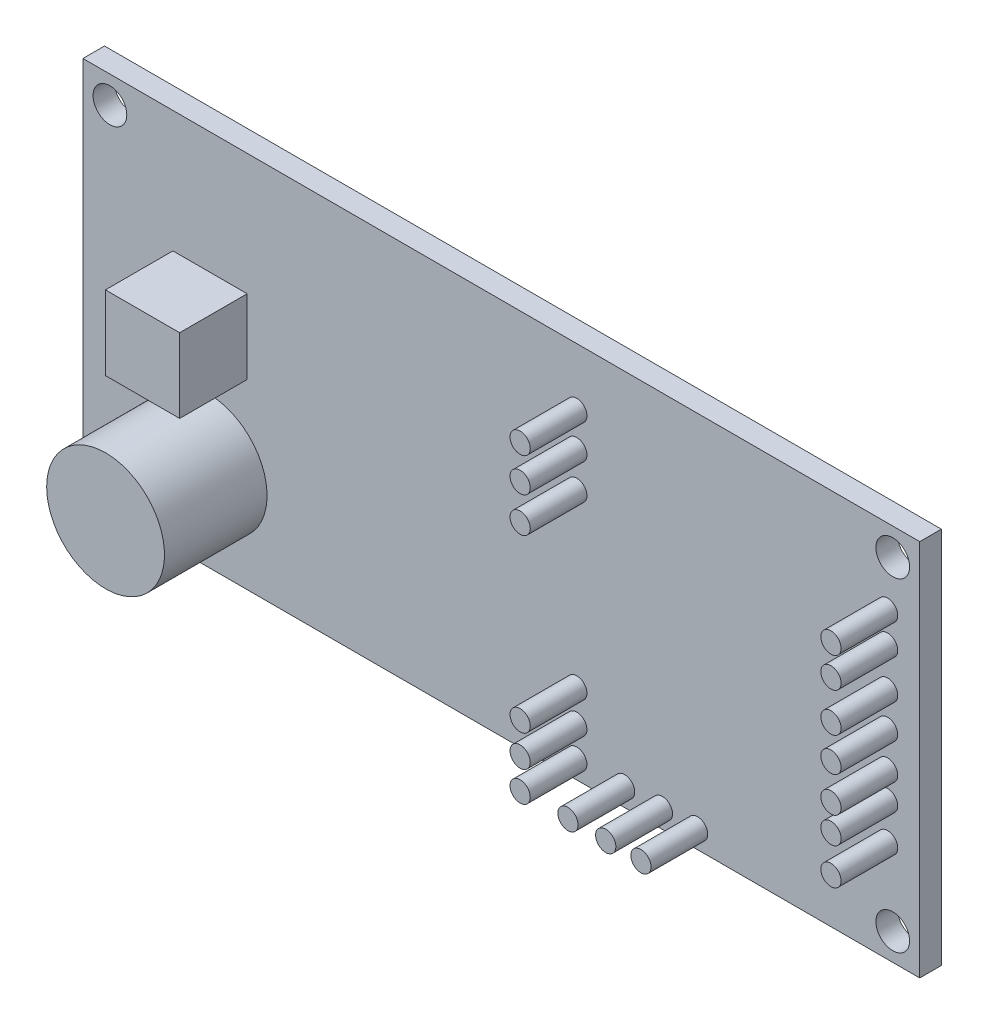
from build123d import *

# Parameters (mm, degrees)
SKETCH1_W      = 62
SKETCH1_H      = 28
SKETCH1_R      = 1.25
EXTRUDE1_DEPTH = 0.8
SKETCH3_R      = 0.75
EXTRUDE3_DEPTH = 4.2
SKETCH4_R      = 4.364752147
EXTRUDE4_DEPTH = 7.6
SKETCH5_W      = 5.500362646
SKETCH5_H      = 5.500362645
EXTRUDE5_DEPTH = 5
SKETCH6_W      = 4.195191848
SKETCH6_H      = 3.635832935
SKETCH6_W_2    = 4.101965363
EXTRUDE6_DEPTH = 3.1


with BuildPart() as part:
    # Sketch1 → Extrude1 (new, symmetric)
    with BuildSketch(Plane.XY):
        with Locations((31, 14)):
            Rectangle(SKETCH1_W, SKETCH1_H)
        with Locations((2, 2)):
            Circle(SKETCH1_R, mode=Mode.SUBTRACT)
        with Locations((60, 26)):
            Circle(SKETCH1_R, mode=Mode.SUBTRACT)
        with Locations((60, 2)):
            Circle(SKETCH1_R, mode=Mode.SUBTRACT)
        with Locations((2, 26)):
            Circle(SKETCH1_R, mode=Mode.SUBTRACT)
    extrude(amount=EXTRUDE1_DEPTH, both=True)

    # Sketch3 → Extrude3 (add)
    with BuildSketch(Plane.XY.offset(0.8)):
        with Locations(Location((59.620531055, 22.43699694, 0), (0, 0, 180))):
            Circle(SKETCH3_R)
        with Locations(Location((59.620531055, 20.199561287, 0), (0, 0, 180))):
            Circle(SKETCH3_R)
        with Locations(Location((59.620531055, 17.309540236, 0), (0, 0, 180))):
            Circle(SKETCH3_R)
        with Locations(Location((59.620531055, 14.792425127, 0), (0, 0, 180))):
            Circle(SKETCH3_R)
        with Locations(Location((59.620531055, 12.182083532, 0), (0, 0, 180))):
            Circle(SKETCH3_R)
        with Locations(Location((59.620531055, 10.224327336, 0), (0, 0, 180))):
            Circle(SKETCH3_R)
        with Locations(Location((59.620531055, 7.520759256, 0), (0, 0, 180))):
            Circle(SKETCH3_R)
        with Locations(Location((36.593589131, 21.225052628, 0), (0, 0, 180))):
            Circle(SKETCH3_R)
        with Locations(Location((36.593589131, 23.742167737, 0), (0, 0, 180))):
            Circle(SKETCH3_R)
        with Locations(Location((36.593589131, 18.614711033, 0), (0, 0, 180))):
            Circle(SKETCH3_R)
        with Locations(Location((36.593589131, 5.935909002, 0), (0, 0, 180))):
            Circle(SKETCH3_R)
        with Locations(Location((36.593589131, 3.605246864, 0), (0, 0, 180))):
            Circle(SKETCH3_R)
        with Locations(Location((36.593589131, 1.367811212, 0), (0, 0, 180))):
            Circle(SKETCH3_R)
        with Locations(Location((42.932990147, 1.367811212, 0), (0, 0, 180))):
            Circle(SKETCH3_R)
        with Locations(Location((40.136195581, 1.367811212, 0), (0, 0, 180))):
            Circle(SKETCH3_R)
        with Locations(Location((45.543331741, 1.367811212, 0), (0, 0, 180))):
            Circle(SKETCH3_R)
    extrude(amount=EXTRUDE3_DEPTH)

    # Sketch4 → Extrude4 (add)
    with BuildSketch(Plane.XY.offset(0.8)):
        with Locations(Location((9.278228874, 6.774947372, 0), (0, 0, 180))):
            Circle(SKETCH4_R)
    extrude(amount=EXTRUDE4_DEPTH)

    # Sketch5 → Extrude5 (add)
    with BuildSketch(Plane.XY.offset(0.8)):
        with Locations((9.418068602, 16.237435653)):
            Rectangle(SKETCH5_W, SKETCH5_H)
    extrude(amount=EXTRUDE5_DEPTH)

    # Sketch6 → Extrude6 (add)
    with BuildSketch(Plane(origin=(0, 0, -0.8), x_dir=(-1, 0, 0), z_dir=(0, 0, -1))):
        with Locations((-17.528772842, 3.465407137)):
            Rectangle(SKETCH6_W, SKETCH6_H)
        with Locations((-24.940278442, 3.465407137)):
            Rectangle(SKETCH6_W_2, SKETCH6_H)
    extrude(amount=EXTRUDE6_DEPTH)


solid = part.part
